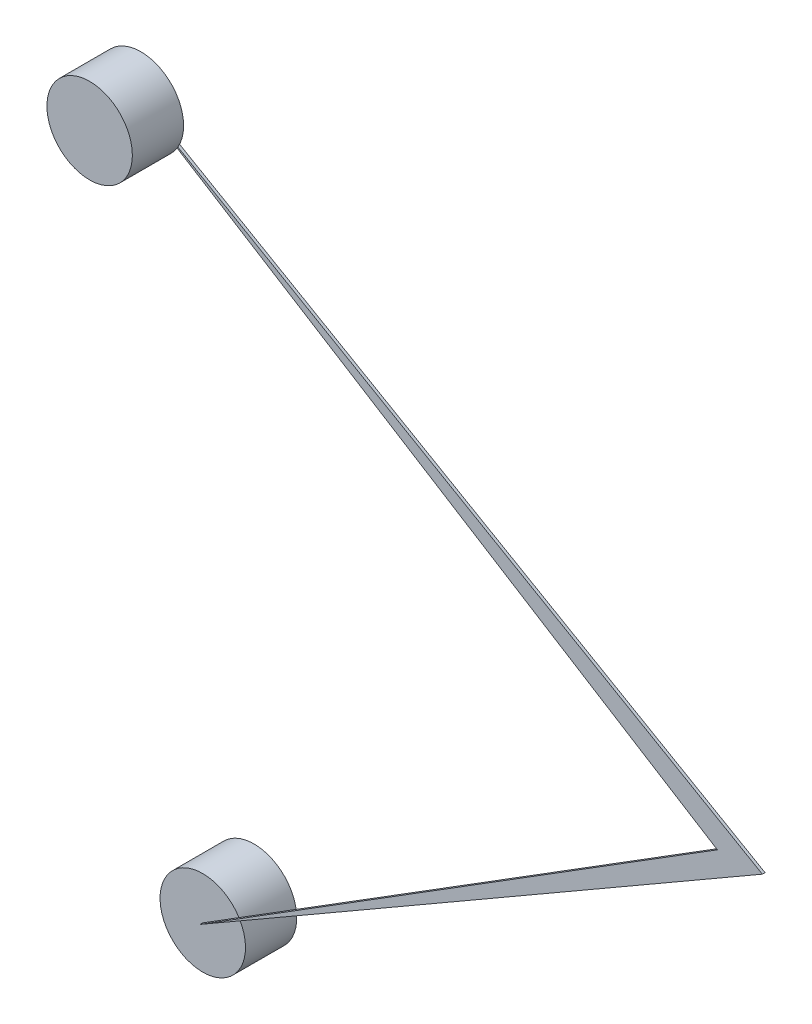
ISO-10303-21;
HEADER;
FILE_DESCRIPTION(('STEP AP214'),'2;1');
FILE_NAME('part.step','',(''),(''),'','','');
FILE_SCHEMA(('AUTOMOTIVE_DESIGN { 1 0 10303 214 1 1 1 1 }'));
ENDSEC;
DATA;
#1=APPLICATION_CONTEXT('core data for automotive mechanical design processes');
#2=APPLICATION_PROTOCOL_DEFINITION('international standard','automotive_design',2000,#1);
#3=PRODUCT_CONTEXT('',#1,'mechanical');
#4=PRODUCT('Part','Part','',(#3));
#5=PRODUCT_RELATED_PRODUCT_CATEGORY('part','',(#4));
#6=PRODUCT_DEFINITION_FORMATION('','',#4);
#7=PRODUCT_DEFINITION_CONTEXT('part definition',#1,'design');
#8=PRODUCT_DEFINITION('design','',#6,#7);
#9=PRODUCT_DEFINITION_SHAPE('','',#8);
#10=(LENGTH_UNIT() NAMED_UNIT(*) SI_UNIT(.MILLI.,.METRE.));
#11=(NAMED_UNIT(*) PLANE_ANGLE_UNIT() SI_UNIT($,.RADIAN.));
#12=(NAMED_UNIT(*) SI_UNIT($,.STERADIAN.) SOLID_ANGLE_UNIT());
#13=UNCERTAINTY_MEASURE_WITH_UNIT(LENGTH_MEASURE(1.E-05),#10,'distance_accuracy_value','');
#14=(GEOMETRIC_REPRESENTATION_CONTEXT(3) GLOBAL_UNCERTAINTY_ASSIGNED_CONTEXT((#13)) GLOBAL_UNIT_ASSIGNED_CONTEXT((#10,
#11,#12)) REPRESENTATION_CONTEXT('',''));
#15=CARTESIAN_POINT('',(0.,0.,0.));
#16=DIRECTION('',(0.,0.,1.));
#17=DIRECTION('',(1.,0.,0.));
#18=AXIS2_PLACEMENT_3D('',#15,#16,#17);
#19=CARTESIAN_POINT('',(-9.12930852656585,-5.27080873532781,1.));
#20=DIRECTION('',(0.,0.,-1.));
#21=DIRECTION('',(-1.,0.,0.));
#22=AXIS2_PLACEMENT_3D('',#19,#20,#21);
#23=PLANE('',#22);
#24=CARTESIAN_POINT('',(-230.96897518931,133.35,1.));
#25=DIRECTION('',(0.,0.,1.));
#26=DIRECTION('',(1.,0.,0.));
#27=AXIS2_PLACEMENT_3D('',#24,#25,#26);
#28=CIRCLE('',#27,15.875);
#29=CARTESIAN_POINT('',(-217.506211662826,124.937531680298,1.));
#30=VERTEX_POINT('',#29);
#31=CARTESIAN_POINT('',(-217.220821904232,125.4125,1.));
#32=VERTEX_POINT('',#31);
#33=EDGE_CURVE('E53',#30,#32,#28,.T.);
#34=ORIENTED_EDGE('',*,*,#33,.F.);
#35=DIRECTION('',(0.848048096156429,-0.5299192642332,0.));
#36=VECTOR('',#35,1.);
#37=CARTESIAN_POINT('',(-230.96897518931,133.35,1.));
#38=LINE('',#37,#36);
#39=CARTESIAN_POINT('',(-16.7279673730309,-0.522639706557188,1.));
#40=VERTEX_POINT('',#39);
#41=EDGE_CURVE('E122',#30,#40,#38,.T.);
#42=ORIENTED_EDGE('',*,*,#41,.T.);
#43=DIRECTION('',(-0.848048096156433,-0.529919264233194,0.));
#44=VECTOR('',#43,1.);
#45=CARTESIAN_POINT('',(-16.7279673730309,-0.522639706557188,1.));
#46=LINE('',#45,#44);
#47=CARTESIAN_POINT('',(-208.971929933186,-120.649999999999,1.));
#48=VERTEX_POINT('',#47);
#49=EDGE_CURVE('E126',#40,#48,#46,.T.);
#50=ORIENTED_EDGE('',*,*,#49,.T.);
#51=DIRECTION('',(0.866025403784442,0.499999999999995,0.));
#52=VECTOR('',#51,1.);
#53=CARTESIAN_POINT('',(-208.971929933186,-120.649999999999,1.));
#54=LINE('',#53,#52);
#55=CARTESIAN_POINT('',(0.,0.,1.));
#56=VERTEX_POINT('',#55);
#57=EDGE_CURVE('E115',#48,#56,#54,.T.);
#58=ORIENTED_EDGE('',*,*,#57,.T.);
#59=DIRECTION('',(-0.866025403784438,0.500000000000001,0.));
#60=VECTOR('',#59,1.);
#61=CARTESIAN_POINT('',(0.,0.,1.));
#62=LINE('',#61,#60);
#63=EDGE_CURVE('E120',#56,#32,#62,.T.);
#64=ORIENTED_EDGE('',*,*,#63,.T.);
#65=EDGE_LOOP('',(#34,#42,#50,#58,#64));
#66=FACE_BOUND('',#65,.T.);
#67=ADVANCED_FACE('F30',(#66),#23,.F.);
#68=CARTESIAN_POINT('',(-208.971929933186,-120.649999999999,1.));
#69=DIRECTION('',(-0.499999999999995,0.866025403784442,0.));
#70=DIRECTION('',(-0.866025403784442,-0.499999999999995,0.));
#71=AXIS2_PLACEMENT_3D('',#68,#69,#70);
#72=PLANE('',#71);
#73=DIRECTION('',(0.866025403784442,0.499999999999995,0.));
#74=VECTOR('',#73,1.);
#75=CARTESIAN_POINT('',(-208.971929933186,-120.649999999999,0.));
#76=LINE('',#75,#74);
#77=CARTESIAN_POINT('',(-208.971929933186,-120.649999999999,0.));
#78=VERTEX_POINT('',#77);
#79=CARTESIAN_POINT('',(-195.223776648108,-112.712499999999,0.));
#80=VERTEX_POINT('',#79);
#81=EDGE_CURVE('E85',#78,#80,#76,.T.);
#82=ORIENTED_EDGE('',*,*,#81,.T.);
#83=CARTESIAN_POINT('',(0.,0.,0.));
#84=VERTEX_POINT('',#83);
#85=EDGE_CURVE('E87',#80,#84,#76,.T.);
#86=ORIENTED_EDGE('',*,*,#85,.T.);
#87=DIRECTION('',(0.,0.,-1.));
#88=VECTOR('',#87,1.);
#89=CARTESIAN_POINT('',(0.,0.,1.));
#90=LINE('',#89,#88);
#91=EDGE_CURVE('E11',#56,#84,#90,.T.);
#92=ORIENTED_EDGE('',*,*,#91,.F.);
#93=ORIENTED_EDGE('',*,*,#57,.F.);
#94=DIRECTION('',(0.,0.,-1.));
#95=VECTOR('',#94,1.);
#96=CARTESIAN_POINT('',(-208.971929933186,-120.649999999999,1.));
#97=LINE('',#96,#95);
#98=EDGE_CURVE('E91',#48,#78,#97,.T.);
#99=ORIENTED_EDGE('',*,*,#98,.T.);
#100=EDGE_LOOP('',(#82,#86,#92,#93,#99));
#101=FACE_BOUND('',#100,.T.);
#102=ADVANCED_FACE('F32',(#101),#72,.F.);
#103=CARTESIAN_POINT('',(0.,0.,1.));
#104=DIRECTION('',(-0.500000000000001,-0.866025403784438,0.));
#105=DIRECTION('',(0.866025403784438,-0.500000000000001,0.));
#106=AXIS2_PLACEMENT_3D('',#103,#104,#105);
#107=PLANE('',#106);
#108=DIRECTION('',(-0.866025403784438,0.500000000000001,0.));
#109=VECTOR('',#108,1.);
#110=CARTESIAN_POINT('',(0.,0.,0.));
#111=LINE('',#110,#109);
#112=CARTESIAN_POINT('',(-230.96897518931,133.35,0.));
#113=VERTEX_POINT('',#112);
#114=EDGE_CURVE('E95',#84,#113,#111,.T.);
#115=ORIENTED_EDGE('',*,*,#114,.T.);
#116=DIRECTION('',(0.,0.,-1.));
#117=VECTOR('',#116,1.);
#118=CARTESIAN_POINT('',(-230.96897518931,133.35,1.));
#119=LINE('',#118,#117);
#120=CARTESIAN_POINT('',(-230.96897518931,133.35,1.));
#121=VERTEX_POINT('',#120);
#122=EDGE_CURVE('E38',#121,#113,#119,.T.);
#123=ORIENTED_EDGE('',*,*,#122,.F.);
#124=EDGE_CURVE('E118',#32,#121,#62,.T.);
#125=ORIENTED_EDGE('',*,*,#124,.F.);
#126=ORIENTED_EDGE('',*,*,#63,.F.);
#127=ORIENTED_EDGE('',*,*,#91,.T.);
#128=EDGE_LOOP('',(#115,#123,#125,#126,#127));
#129=FACE_BOUND('',#128,.T.);
#130=ADVANCED_FACE('F169',(#129),#107,.F.);
#131=CARTESIAN_POINT('',(-230.96897518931,133.35,1.));
#132=DIRECTION('',(0.5299192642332,0.848048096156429,0.));
#133=DIRECTION('',(-0.848048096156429,0.5299192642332,0.));
#134=AXIS2_PLACEMENT_3D('',#131,#132,#133);
#135=PLANE('',#134);
#136=DIRECTION('',(0.848048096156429,-0.5299192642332,0.));
#137=VECTOR('',#136,1.);
#138=CARTESIAN_POINT('',(-230.96897518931,133.35,0.));
#139=LINE('',#138,#137);
#140=CARTESIAN_POINT('',(-16.7279673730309,-0.522639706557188,0.));
#141=VERTEX_POINT('',#140);
#142=EDGE_CURVE('E129',#113,#141,#139,.T.);
#143=ORIENTED_EDGE('',*,*,#142,.T.);
#144=DIRECTION('',(0.,0.,-1.));
#145=VECTOR('',#144,1.);
#146=CARTESIAN_POINT('',(-16.7279673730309,-0.522639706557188,1.));
#147=LINE('',#146,#145);
#148=EDGE_CURVE('E133',#40,#141,#147,.T.);
#149=ORIENTED_EDGE('',*,*,#148,.F.);
#150=ORIENTED_EDGE('',*,*,#41,.F.);
#151=EDGE_CURVE('E123',#121,#30,#38,.T.);
#152=ORIENTED_EDGE('',*,*,#151,.F.);
#153=ORIENTED_EDGE('',*,*,#122,.T.);
#154=EDGE_LOOP('',(#143,#149,#150,#152,#153));
#155=FACE_BOUND('',#154,.T.);
#156=ADVANCED_FACE('F138',(#155),#135,.F.);
#157=CARTESIAN_POINT('',(-16.7279673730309,-0.522639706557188,1.));
#158=DIRECTION('',(0.529919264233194,-0.848048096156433,0.));
#159=DIRECTION('',(0.848048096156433,0.529919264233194,0.));
#160=AXIS2_PLACEMENT_3D('',#157,#158,#159);
#161=PLANE('',#160);
#162=DIRECTION('',(-0.848048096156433,-0.529919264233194,0.));
#163=VECTOR('',#162,1.);
#164=CARTESIAN_POINT('',(-16.7279673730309,-0.522639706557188,0.));
#165=LINE('',#164,#163);
#166=CARTESIAN_POINT('',(-195.509166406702,-112.237531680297,0.));
#167=VERTEX_POINT('',#166);
#168=EDGE_CURVE('E119',#141,#167,#165,.T.);
#169=ORIENTED_EDGE('',*,*,#168,.T.);
#170=EDGE_CURVE('E103',#167,#78,#165,.T.);
#171=ORIENTED_EDGE('',*,*,#170,.T.);
#172=ORIENTED_EDGE('',*,*,#98,.F.);
#173=ORIENTED_EDGE('',*,*,#49,.F.);
#174=ORIENTED_EDGE('',*,*,#148,.T.);
#175=EDGE_LOOP('',(#169,#171,#172,#173,#174));
#176=FACE_BOUND('',#175,.T.);
#177=ADVANCED_FACE('F144',(#176),#161,.F.);
#178=CARTESIAN_POINT('',(-9.12930852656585,-5.27080873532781,0.));
#179=DIRECTION('',(0.,0.,-1.));
#180=DIRECTION('',(-1.,0.,0.));
#181=AXIS2_PLACEMENT_3D('',#178,#179,#180);
#182=PLANE('',#181);
#183=CARTESIAN_POINT('',(-208.971929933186,-120.649999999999,0.));
#184=DIRECTION('',(0.,0.,-1.));
#185=DIRECTION('',(-1.,0.,0.));
#186=AXIS2_PLACEMENT_3D('',#183,#184,#185);
#187=CIRCLE('',#186,15.875);
#188=EDGE_CURVE('E45',#167,#80,#187,.T.);
#189=ORIENTED_EDGE('',*,*,#188,.F.);
#190=ORIENTED_EDGE('',*,*,#168,.F.);
#191=ORIENTED_EDGE('',*,*,#142,.F.);
#192=ORIENTED_EDGE('',*,*,#114,.F.);
#193=ORIENTED_EDGE('',*,*,#85,.F.);
#194=EDGE_LOOP('',(#189,#190,#191,#192,#193));
#195=FACE_BOUND('',#194,.T.);
#196=ADVANCED_FACE('F97',(#195),#182,.T.);
#197=CARTESIAN_POINT('',(-230.96897518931,133.35,1.));
#198=DIRECTION('',(0.,0.,1.));
#199=DIRECTION('',(1.,0.,0.));
#200=AXIS2_PLACEMENT_3D('',#197,#198,#199);
#201=PLANE('',#200);
#202=EDGE_CURVE('E109',#32,#30,#28,.T.);
#203=ORIENTED_EDGE('',*,*,#202,.F.);
#204=ORIENTED_EDGE('',*,*,#124,.T.);
#205=ORIENTED_EDGE('',*,*,#151,.T.);
#206=EDGE_LOOP('',(#203,#204,#205));
#207=FACE_BOUND('',#206,.T.);
#208=ADVANCED_FACE('F149',(#207),#201,.F.);
#209=CARTESIAN_POINT('',(-230.96897518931,133.35,20.05));
#210=DIRECTION('',(0.,0.,-1.));
#211=DIRECTION('',(-1.,0.,0.));
#212=AXIS2_PLACEMENT_3D('',#209,#210,#211);
#213=CYLINDRICAL_SURFACE('',#212,15.875);
#214=CARTESIAN_POINT('',(-230.96897518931,133.35,20.05));
#215=DIRECTION('',(0.,0.,1.));
#216=DIRECTION('',(1.,0.,0.));
#217=AXIS2_PLACEMENT_3D('',#214,#215,#216);
#218=CIRCLE('',#217,15.875);
#219=CARTESIAN_POINT('',(-215.09397518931,133.35,20.05));
#220=VERTEX_POINT('',#219);
#221=EDGE_CURVE('E99',#220,#220,#218,.T.);
#222=ORIENTED_EDGE('',*,*,#221,.F.);
#223=EDGE_LOOP('',(#222));
#224=FACE_BOUND('',#223,.T.);
#225=ORIENTED_EDGE('',*,*,#33,.T.);
#226=ORIENTED_EDGE('',*,*,#202,.T.);
#227=EDGE_LOOP('',(#225,#226));
#228=FACE_BOUND('',#227,.T.);
#229=ADVANCED_FACE('F151',(#224,#228),#213,.T.);
#230=CARTESIAN_POINT('',(-230.96897518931,133.35,20.05));
#231=DIRECTION('',(0.,0.,1.));
#232=DIRECTION('',(1.,0.,0.));
#233=AXIS2_PLACEMENT_3D('',#230,#231,#232);
#234=PLANE('',#233);
#235=ORIENTED_EDGE('',*,*,#221,.T.);
#236=EDGE_LOOP('',(#235));
#237=FACE_BOUND('',#236,.T.);
#238=ADVANCED_FACE('F153',(#237),#234,.T.);
#239=CARTESIAN_POINT('',(-208.971929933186,-120.649999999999,-19.05));
#240=DIRECTION('',(0.,0.,1.));
#241=DIRECTION('',(1.,0.,0.));
#242=AXIS2_PLACEMENT_3D('',#239,#240,#241);
#243=CYLINDRICAL_SURFACE('',#242,15.875);
#244=CARTESIAN_POINT('',(-208.971929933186,-120.649999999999,-19.05));
#245=DIRECTION('',(0.,0.,-1.));
#246=DIRECTION('',(-1.,0.,0.));
#247=AXIS2_PLACEMENT_3D('',#244,#245,#246);
#248=CIRCLE('',#247,15.875);
#249=CARTESIAN_POINT('',(-224.846929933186,-120.649999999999,-19.05));
#250=VERTEX_POINT('',#249);
#251=EDGE_CURVE('E107',#250,#250,#248,.T.);
#252=ORIENTED_EDGE('',*,*,#251,.F.);
#253=EDGE_LOOP('',(#252));
#254=FACE_BOUND('',#253,.T.);
#255=ORIENTED_EDGE('',*,*,#188,.T.);
#256=EDGE_CURVE('E101',#80,#167,#187,.T.);
#257=ORIENTED_EDGE('',*,*,#256,.T.);
#258=EDGE_LOOP('',(#255,#257));
#259=FACE_BOUND('',#258,.T.);
#260=ADVANCED_FACE('F106',(#254,#259),#243,.T.);
#261=CARTESIAN_POINT('',(-208.971929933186,-120.649999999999,-19.05));
#262=DIRECTION('',(0.,0.,-1.));
#263=DIRECTION('',(-1.,0.,0.));
#264=AXIS2_PLACEMENT_3D('',#261,#262,#263);
#265=PLANE('',#264);
#266=ORIENTED_EDGE('',*,*,#251,.T.);
#267=EDGE_LOOP('',(#266));
#268=FACE_BOUND('',#267,.T.);
#269=ADVANCED_FACE('F232',(#268),#265,.T.);
#270=CARTESIAN_POINT('',(-208.971929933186,-120.649999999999,0.));
#271=DIRECTION('',(0.,0.,-1.));
#272=DIRECTION('',(-1.,0.,0.));
#273=AXIS2_PLACEMENT_3D('',#270,#271,#272);
#274=PLANE('',#273);
#275=ORIENTED_EDGE('',*,*,#81,.F.);
#276=ORIENTED_EDGE('',*,*,#170,.F.);
#277=ORIENTED_EDGE('',*,*,#256,.F.);
#278=EDGE_LOOP('',(#275,#276,#277));
#279=FACE_BOUND('',#278,.T.);
#280=ADVANCED_FACE('F102',(#279),#274,.F.);
#281=CLOSED_SHELL('',(#67,#102,#130,#156,#177,#196,#208,#229,#238,#260,#269,#280));
#282=MANIFOLD_SOLID_BREP('B2',#281);
#283=ADVANCED_BREP_SHAPE_REPRESENTATION('',(#18,#282),#14);
#284=SHAPE_DEFINITION_REPRESENTATION(#9,#283);
ENDSEC;
END-ISO-10303-21;
